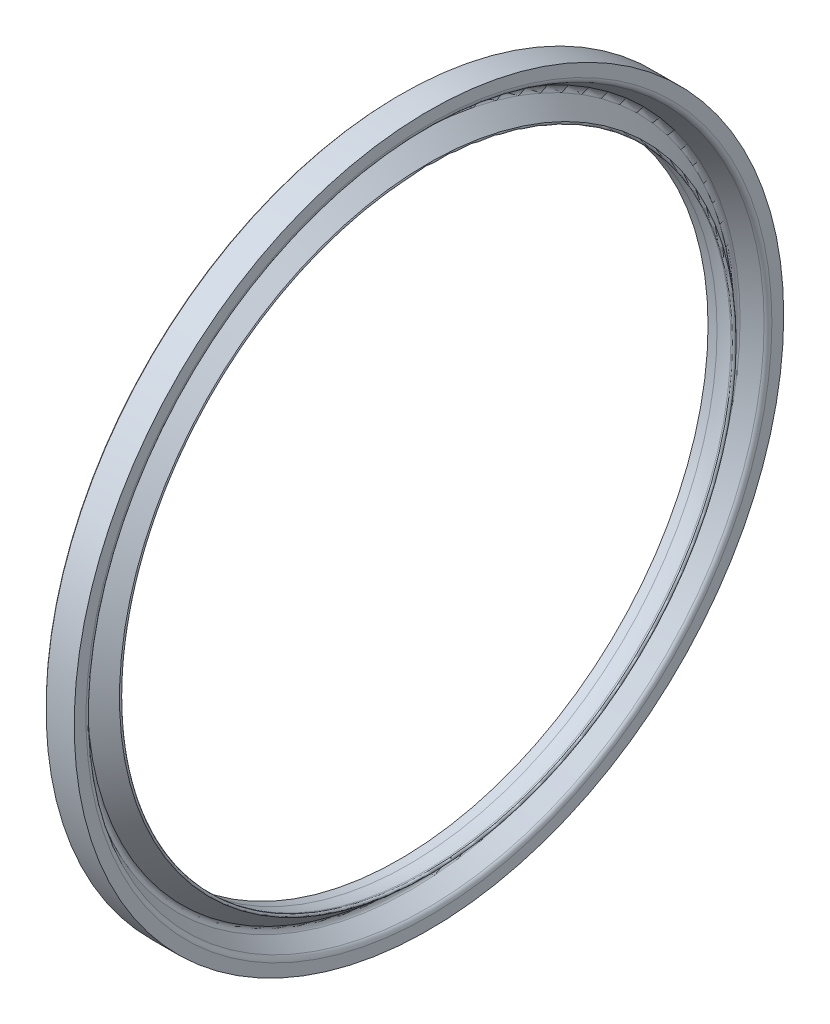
ISO-10303-21;
HEADER;
FILE_DESCRIPTION(('STEP AP214'),'2;1');
FILE_NAME('part.step','',(''),(''),'','','');
FILE_SCHEMA(('AUTOMOTIVE_DESIGN { 1 0 10303 214 1 1 1 1 }'));
ENDSEC;
DATA;
#1=APPLICATION_CONTEXT('core data for automotive mechanical design processes');
#2=APPLICATION_PROTOCOL_DEFINITION('international standard','automotive_design',2000,#1);
#3=PRODUCT_CONTEXT('',#1,'mechanical');
#4=PRODUCT('Part','Part','',(#3));
#5=PRODUCT_RELATED_PRODUCT_CATEGORY('part','',(#4));
#6=PRODUCT_DEFINITION_FORMATION('','',#4);
#7=PRODUCT_DEFINITION_CONTEXT('part definition',#1,'design');
#8=PRODUCT_DEFINITION('design','',#6,#7);
#9=PRODUCT_DEFINITION_SHAPE('','',#8);
#10=(LENGTH_UNIT() NAMED_UNIT(*) SI_UNIT(.MILLI.,.METRE.));
#11=(NAMED_UNIT(*) PLANE_ANGLE_UNIT() SI_UNIT($,.RADIAN.));
#12=(NAMED_UNIT(*) SI_UNIT($,.STERADIAN.) SOLID_ANGLE_UNIT());
#13=UNCERTAINTY_MEASURE_WITH_UNIT(LENGTH_MEASURE(1.E-05),#10,'distance_accuracy_value','');
#14=(GEOMETRIC_REPRESENTATION_CONTEXT(3) GLOBAL_UNCERTAINTY_ASSIGNED_CONTEXT((#13)) GLOBAL_UNIT_ASSIGNED_CONTEXT((#10,
#11,#12)) REPRESENTATION_CONTEXT('',''));
#15=CARTESIAN_POINT('',(0.,0.,0.));
#16=DIRECTION('',(0.,0.,1.));
#17=DIRECTION('',(1.,0.,0.));
#18=AXIS2_PLACEMENT_3D('',#15,#16,#17);
#19=CARTESIAN_POINT('',(2.43404063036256,0.,0.));
#20=DIRECTION('',(1.,0.,0.));
#21=DIRECTION('',(0.,0.,-1.));
#22=AXIS2_PLACEMENT_3D('',#19,#20,#21);
#23=CYLINDRICAL_SURFACE('',#22,58.);
#24=CARTESIAN_POINT('',(0.,0.,0.));
#25=DIRECTION('',(1.,0.,0.));
#26=DIRECTION('',(0.,0.,-1.));
#27=AXIS2_PLACEMENT_3D('',#24,#25,#26);
#28=CIRCLE('',#27,58.);
#29=CARTESIAN_POINT('',(0.,0.,-58.));
#30=VERTEX_POINT('',#29);
#31=EDGE_CURVE('E10',#30,#30,#28,.T.);
#32=ORIENTED_EDGE('',*,*,#31,.F.);
#33=EDGE_LOOP('',(#32));
#34=FACE_BOUND('',#33,.T.);
#35=CARTESIAN_POINT('',(-4.59999999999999,0.,0.));
#36=DIRECTION('',(1.,0.,0.));
#37=DIRECTION('',(0.,0.,-1.));
#38=AXIS2_PLACEMENT_3D('',#35,#36,#37);
#39=CIRCLE('',#38,58.);
#40=CARTESIAN_POINT('',(-4.59999999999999,0.,-58.));
#41=VERTEX_POINT('',#40);
#42=EDGE_CURVE('E71',#41,#41,#39,.T.);
#43=ORIENTED_EDGE('',*,*,#42,.T.);
#44=EDGE_LOOP('',(#43));
#45=FACE_BOUND('',#44,.T.);
#46=ADVANCED_FACE('F31',(#34,#45),#23,.T.);
#47=CARTESIAN_POINT('',(0.,-58.,0.));
#48=DIRECTION('',(-1.,0.,0.));
#49=DIRECTION('',(0.,0.,1.));
#50=AXIS2_PLACEMENT_3D('',#47,#48,#49);
#51=PLANE('',#50);
#52=CARTESIAN_POINT('',(0.,0.,0.));
#53=DIRECTION('',(1.,0.,0.));
#54=DIRECTION('',(0.,0.,-1.));
#55=AXIS2_PLACEMENT_3D('',#52,#53,#54);
#56=CIRCLE('',#55,56.0659442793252);
#57=CARTESIAN_POINT('',(0.,0.,-56.0659442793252));
#58=VERTEX_POINT('',#57);
#59=EDGE_CURVE('E37',#58,#58,#56,.T.);
#60=ORIENTED_EDGE('',*,*,#59,.F.);
#61=EDGE_LOOP('',(#60));
#62=FACE_BOUND('',#61,.T.);
#63=ORIENTED_EDGE('',*,*,#31,.T.);
#64=EDGE_LOOP('',(#63));
#65=FACE_BOUND('',#64,.T.);
#66=ADVANCED_FACE('F132',(#62,#65),#51,.F.);
#67=CARTESIAN_POINT('',(-0.934292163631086,0.,0.));
#68=DIRECTION('',(1.,0.,0.));
#69=DIRECTION('',(0.,0.,-1.));
#70=AXIS2_PLACEMENT_3D('',#67,#68,#69);
#71=TOROIDAL_SURFACE('',#70,56.0659442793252,0.934292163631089);
#72=CARTESIAN_POINT('',(-0.467146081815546,0.,0.));
#73=DIRECTION('',(1.,0.,0.));
#74=DIRECTION('',(0.,0.,-1.));
#75=AXIS2_PLACEMENT_3D('',#72,#73,#74);
#76=CIRCLE('',#75,55.256823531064);
#77=CARTESIAN_POINT('',(-0.467146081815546,0.,-55.256823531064));
#78=VERTEX_POINT('',#77);
#79=EDGE_CURVE('E41',#78,#78,#76,.T.);
#80=ORIENTED_EDGE('',*,*,#79,.F.);
#81=EDGE_LOOP('',(#80));
#82=FACE_BOUND('',#81,.T.);
#83=ORIENTED_EDGE('',*,*,#59,.T.);
#84=EDGE_LOOP('',(#83));
#85=FACE_BOUND('',#84,.T.);
#86=ADVANCED_FACE('F127',(#82,#85),#71,.T.);
#87=CARTESIAN_POINT('',(-0.467146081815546,0.,0.));
#88=DIRECTION('',(1.,0.,0.));
#89=DIRECTION('',(0.,0.,-1.));
#90=AXIS2_PLACEMENT_3D('',#87,#88,#89);
#91=CONICAL_SURFACE('',#90,55.256823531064,0.5235987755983);
#92=CARTESIAN_POINT('',(-2.95475450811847,0.,0.));
#93=DIRECTION('',(1.,0.,0.));
#94=DIRECTION('',(0.,0.,-1.));
#95=AXIS2_PLACEMENT_3D('',#92,#93,#94);
#96=CIRCLE('',#95,53.8206021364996);
#97=CARTESIAN_POINT('',(-2.95475450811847,0.,-53.8206021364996));
#98=VERTEX_POINT('',#97);
#99=EDGE_CURVE('E45',#98,#98,#96,.T.);
#100=ORIENTED_EDGE('',*,*,#99,.F.);
#101=EDGE_LOOP('',(#100));
#102=FACE_BOUND('',#101,.T.);
#103=ORIENTED_EDGE('',*,*,#79,.T.);
#104=EDGE_LOOP('',(#103));
#105=FACE_BOUND('',#104,.T.);
#106=ADVANCED_FACE('F121',(#102,#105),#91,.F.);
#107=CARTESIAN_POINT('',(-2.64400425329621,0.,0.));
#108=DIRECTION('',(1.,0.,0.));
#109=DIRECTION('',(0.,0.,-1.));
#110=AXIS2_PLACEMENT_3D('',#107,#108,#109);
#111=TOROIDAL_SURFACE('',#110,53.2823669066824,0.621500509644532);
#112=CARTESIAN_POINT('',(-3.04349708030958,0.,0.));
#113=DIRECTION('',(1.,0.,0.));
#114=DIRECTION('',(0.,0.,-1.));
#115=AXIS2_PLACEMENT_3D('',#112,#113,#114);
#116=CIRCLE('',#115,52.8062698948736);
#117=CARTESIAN_POINT('',(-3.04349708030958,0.,-52.8062698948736));
#118=VERTEX_POINT('',#117);
#119=EDGE_CURVE('E50',#118,#118,#116,.T.);
#120=ORIENTED_EDGE('',*,*,#119,.F.);
#121=EDGE_LOOP('',(#120));
#122=FACE_BOUND('',#121,.T.);
#123=ORIENTED_EDGE('',*,*,#99,.T.);
#124=EDGE_LOOP('',(#123));
#125=FACE_BOUND('',#124,.T.);
#126=ADVANCED_FACE('F115',(#122,#125),#111,.F.);
#127=CARTESIAN_POINT('',(-3.04349708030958,0.,0.));
#128=DIRECTION('',(-1.,0.,0.));
#129=DIRECTION('',(0.,0.,1.));
#130=AXIS2_PLACEMENT_3D('',#127,#128,#129);
#131=CONICAL_SURFACE('',#130,52.8062698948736,0.698131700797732);
#132=CARTESIAN_POINT('',(-0.186922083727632,0.,0.));
#133=DIRECTION('',(1.,0.,0.));
#134=DIRECTION('',(0.,0.,-1.));
#135=AXIS2_PLACEMENT_3D('',#132,#133,#134);
#136=CIRCLE('',#135,50.4093188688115);
#137=CARTESIAN_POINT('',(-0.186922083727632,0.,-50.4093188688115));
#138=VERTEX_POINT('',#137);
#139=EDGE_CURVE('E53',#138,#138,#136,.T.);
#140=ORIENTED_EDGE('',*,*,#139,.F.);
#141=EDGE_LOOP('',(#140));
#142=FACE_BOUND('',#141,.T.);
#143=ORIENTED_EDGE('',*,*,#119,.T.);
#144=EDGE_LOOP('',(#143));
#145=FACE_BOUND('',#144,.T.);
#146=ADVANCED_FACE('F109',(#142,#145),#131,.T.);
#147=CARTESIAN_POINT('',(-0.338832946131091,0.,0.));
#148=DIRECTION('',(1.,0.,0.));
#149=DIRECTION('',(0.,0.,-1.));
#150=AXIS2_PLACEMENT_3D('',#147,#148,#149);
#151=TOROIDAL_SURFACE('',#150,50.2282785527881,0.236331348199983);
#152=CARTESIAN_POINT('',(-0.4,0.,0.));
#153=DIRECTION('',(1.,0.,0.));
#154=DIRECTION('',(0.,0.,-1.));
#155=AXIS2_PLACEMENT_3D('',#152,#153,#154);
#156=CIRCLE('',#155,50.);
#157=CARTESIAN_POINT('',(-0.4,0.,-50.));
#158=VERTEX_POINT('',#157);
#159=EDGE_CURVE('E56',#158,#158,#156,.T.);
#160=ORIENTED_EDGE('',*,*,#159,.F.);
#161=EDGE_LOOP('',(#160));
#162=FACE_BOUND('',#161,.T.);
#163=ORIENTED_EDGE('',*,*,#139,.T.);
#164=EDGE_LOOP('',(#163));
#165=FACE_BOUND('',#164,.T.);
#166=ADVANCED_FACE('F103',(#162,#165),#151,.T.);
#167=CARTESIAN_POINT('',(-0.4,0.,0.));
#168=DIRECTION('',(-1.,0.,0.));
#169=DIRECTION('',(0.,0.,1.));
#170=AXIS2_PLACEMENT_3D('',#167,#168,#169);
#171=CONICAL_SURFACE('',#170,50.,0.261799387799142);
#172=CARTESIAN_POINT('',(-0.715438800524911,0.,0.));
#173=DIRECTION('',(1.,0.,0.));
#174=DIRECTION('',(0.,0.,-1.));
#175=AXIS2_PLACEMENT_3D('',#172,#173,#174);
#176=CIRCLE('',#175,50.0845215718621);
#177=CARTESIAN_POINT('',(-0.715438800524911,0.,-50.0845215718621));
#178=VERTEX_POINT('',#177);
#179=EDGE_CURVE('E59',#178,#178,#176,.T.);
#180=ORIENTED_EDGE('',*,*,#179,.F.);
#181=EDGE_LOOP('',(#180));
#182=FACE_BOUND('',#181,.T.);
#183=ORIENTED_EDGE('',*,*,#159,.T.);
#184=EDGE_LOOP('',(#183));
#185=FACE_BOUND('',#184,.T.);
#186=ADVANCED_FACE('F97',(#182,#185),#171,.F.);
#187=CARTESIAN_POINT('',(-3.32987561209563,0.,0.));
#188=DIRECTION('',(1.,0.,0.));
#189=DIRECTION('',(0.,0.,-1.));
#190=AXIS2_PLACEMENT_3D('',#187,#188,#189);
#191=TOROIDAL_SURFACE('',#190,40.3273105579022,10.1014081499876);
#192=CARTESIAN_POINT('',(-3.32987561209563,0.,0.));
#193=DIRECTION('',(1.,0.,0.));
#194=DIRECTION('',(0.,0.,-1.));
#195=AXIS2_PLACEMENT_3D('',#192,#193,#194);
#196=CIRCLE('',#195,50.4287187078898);
#197=CARTESIAN_POINT('',(-3.32987561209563,0.,-50.4287187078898));
#198=VERTEX_POINT('',#197);
#199=EDGE_CURVE('E62',#198,#198,#196,.T.);
#200=ORIENTED_EDGE('',*,*,#199,.F.);
#201=EDGE_LOOP('',(#200));
#202=FACE_BOUND('',#201,.T.);
#203=ORIENTED_EDGE('',*,*,#179,.T.);
#204=EDGE_LOOP('',(#203));
#205=FACE_BOUND('',#204,.T.);
#206=ADVANCED_FACE('F91',(#202,#205),#191,.F.);
#207=CARTESIAN_POINT('',(2.43404063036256,0.,0.));
#208=DIRECTION('',(1.,0.,0.));
#209=DIRECTION('',(0.,0.,-1.));
#210=AXIS2_PLACEMENT_3D('',#207,#208,#209);
#211=CYLINDRICAL_SURFACE('',#210,50.4287187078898);
#212=CARTESIAN_POINT('',(-4.8,0.,0.));
#213=DIRECTION('',(1.,0.,0.));
#214=DIRECTION('',(0.,0.,-1.));
#215=AXIS2_PLACEMENT_3D('',#212,#213,#214);
#216=CIRCLE('',#215,50.4287187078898);
#217=CARTESIAN_POINT('',(-4.8,0.,-50.4287187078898));
#218=VERTEX_POINT('',#217);
#219=EDGE_CURVE('E65',#218,#218,#216,.T.);
#220=ORIENTED_EDGE('',*,*,#219,.F.);
#221=EDGE_LOOP('',(#220));
#222=FACE_BOUND('',#221,.T.);
#223=ORIENTED_EDGE('',*,*,#199,.T.);
#224=EDGE_LOOP('',(#223));
#225=FACE_BOUND('',#224,.T.);
#226=ADVANCED_FACE('F85',(#222,#225),#211,.F.);
#227=CARTESIAN_POINT('',(-4.8,-57.8,0.));
#228=DIRECTION('',(1.,0.,0.));
#229=DIRECTION('',(0.,0.,-1.));
#230=AXIS2_PLACEMENT_3D('',#227,#228,#229);
#231=PLANE('',#230);
#232=CARTESIAN_POINT('',(-4.8,0.,0.));
#233=DIRECTION('',(1.,0.,0.));
#234=DIRECTION('',(0.,0.,-1.));
#235=AXIS2_PLACEMENT_3D('',#232,#233,#234);
#236=CIRCLE('',#235,57.8);
#237=CARTESIAN_POINT('',(-4.8,0.,-57.8));
#238=VERTEX_POINT('',#237);
#239=EDGE_CURVE('E68',#238,#238,#236,.T.);
#240=ORIENTED_EDGE('',*,*,#239,.F.);
#241=EDGE_LOOP('',(#240));
#242=FACE_BOUND('',#241,.T.);
#243=ORIENTED_EDGE('',*,*,#219,.T.);
#244=EDGE_LOOP('',(#243));
#245=FACE_BOUND('',#244,.T.);
#246=ADVANCED_FACE('F79',(#242,#245),#231,.F.);
#247=CARTESIAN_POINT('',(-4.8,0.,0.));
#248=DIRECTION('',(1.,0.,0.));
#249=DIRECTION('',(0.,0.,-1.));
#250=AXIS2_PLACEMENT_3D('',#247,#248,#249);
#251=CONICAL_SURFACE('',#250,57.8,0.785398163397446);
#252=ORIENTED_EDGE('',*,*,#42,.F.);
#253=EDGE_LOOP('',(#252));
#254=FACE_BOUND('',#253,.T.);
#255=ORIENTED_EDGE('',*,*,#239,.T.);
#256=EDGE_LOOP('',(#255));
#257=FACE_BOUND('',#256,.T.);
#258=ADVANCED_FACE('F76',(#254,#257),#251,.T.);
#259=CLOSED_SHELL('',(#46,#66,#86,#106,#126,#146,#166,#186,#206,#226,#246,#258));
#260=MANIFOLD_SOLID_BREP('B2',#259);
#261=ADVANCED_BREP_SHAPE_REPRESENTATION('',(#18,#260),#14);
#262=SHAPE_DEFINITION_REPRESENTATION(#9,#261);
ENDSEC;
END-ISO-10303-21;
